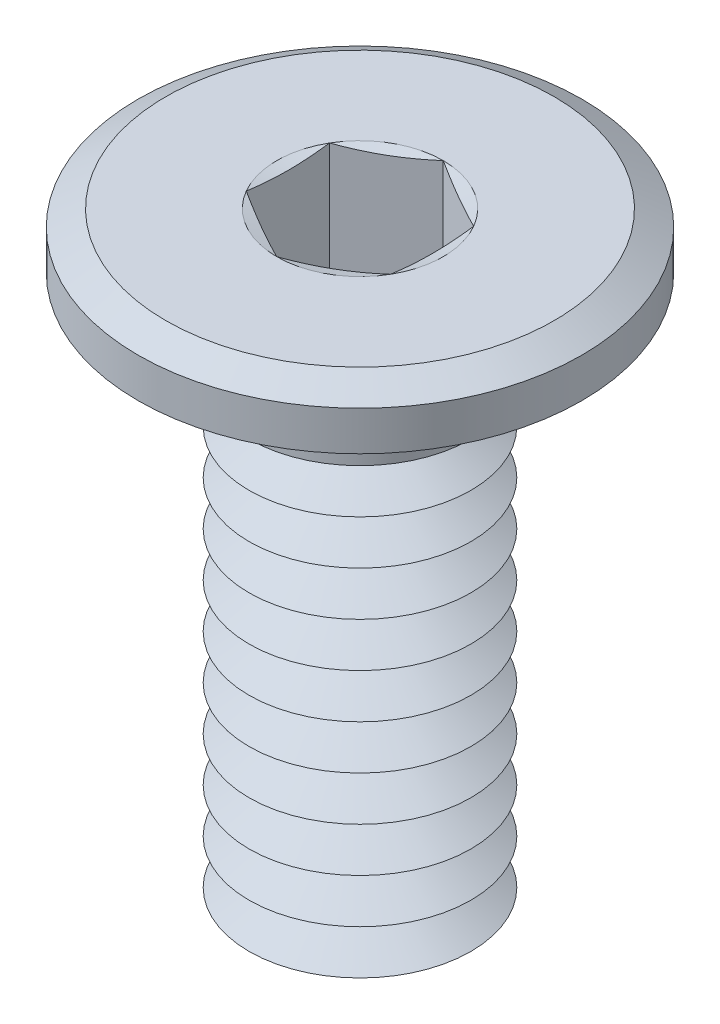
from build123d import *

# Parameters (mm, degrees)
SKETCH1_R           = 2
BOSS_EXTRUDE1_DEPTH = 0.5
SKETCH2_R           = 1
BOSS_EXTRUDE2_DEPTH = 5
LPATTERN1_COUNT     = 11
LPATTERN1_PITCH     = 0.4
FILLET1_R           = 0.1
CHAMFER2_SIZE       = 0.25
CHAMFER2_SIZE2      = 0.144337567
CUT_EXTRUDE1_DEPTH  = 1.2


with BuildPart() as part:
    # Sketch1 → Boss-Extrude1 (new body)
    with BuildSketch(Plane(origin=(0, 0, 0), x_dir=(1, 0, 0), z_dir=(0, 1, 0))):
        with Locations(Location((0, 0, 0), (0, 0, 270))):
            Circle(SKETCH1_R)
    extrude(amount=-BOSS_EXTRUDE1_DEPTH)

    # Sketch2 → Boss-Extrude2 (add)
    with BuildSketch(Plane.XZ.offset(0.5)):
        with Locations(Location((0, 0, 0), (0, 0, 270))):
            Circle(SKETCH2_R)
    extrude(amount=BOSS_EXTRUDE2_DEPTH)

    # Sketch5 → Cut-Revolve1 (revolve, cut)
    with BuildSketch(Plane(origin=(0, 0, 0), x_dir=(0, 0, -1), z_dir=(1, 0, 0))):
        Polygon((-1, -5.7), (-0.653589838, -5.5), (-1, -5.3), align=None)
    cut_revolve1 = revolve(axis=Axis((0, 0.990593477, 0), (0, -1, 0)), mode=Mode.SUBTRACT)

    # LPattern1: Cut-Revolve1 ×11
    with Locations(*[(0, i * LPATTERN1_PITCH, 0) for i in range(1, LPATTERN1_COUNT)]):
        add(cut_revolve1, mode=Mode.SUBTRACT)

    # Fillet1
    fillet1_edges = [part.edges().sort_by_distance(p)[0] for p in [
        (0, -0.5, 1),
    ]]
    fillet(fillet1_edges, radius=FILLET1_R)

    # Chamfer2
    chamfer2_edges = [part.edges().sort_by_distance(p)[0] for p in [
        (0, 0, -2),
    ]]
    chamfer2_side = [part.faces().sort_by_distance(p)[0] for p in [
        (0, 0, 0),
    ]]
    chamfer(chamfer2_edges, length=CHAMFER2_SIZE, length2=CHAMFER2_SIZE2, reference=chamfer2_side[0])

    # Sketch6 → Cut-Extrude1 (cut)
    with BuildSketch(Plane(origin=(0, 0, 0), x_dir=(1, 0, 0), z_dir=(0, 1, 0))):
        Polygon((0, 0.75055535), (-0.65, 0.375277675), (-0.65, -0.375277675), (0, -0.75055535), (0.65, -0.375277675), (0.65, 0.375277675), align=None)
    extrude(amount=-CUT_EXTRUDE1_DEPTH, mode=Mode.SUBTRACT)

    # Cut-Extrude2 cone 1 section (on through the dimple's axis) → Cut-Extrude2 (revolve, cut)
    with BuildSketch(Plane(origin=(0, -1.2, 0), x_dir=(0, 0, 1), z_dir=(1, 0, 0))):
        Polygon((0, 0), (0.65, 0), (0, 0.375277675), align=None)
    revolve(axis=Axis((0, -1.2, 0), (0, -1, 0)), mode=Mode.SUBTRACT)

    # Cut-Extrude3 cone 1 section (on through the dimple's axis) → Cut-Extrude3 (revolve, cut)
    with BuildSketch(Plane(origin=(0, 0, 0), x_dir=(0, 0, 1), z_dir=(1, 0, 0))):
        Polygon((0, 0), (0.75055535, 0), (0, 0.2011107), align=None)
    revolve(axis=Axis((0, 0, 0), (0, -1, 0)), mode=Mode.SUBTRACT)


solid = part.part
